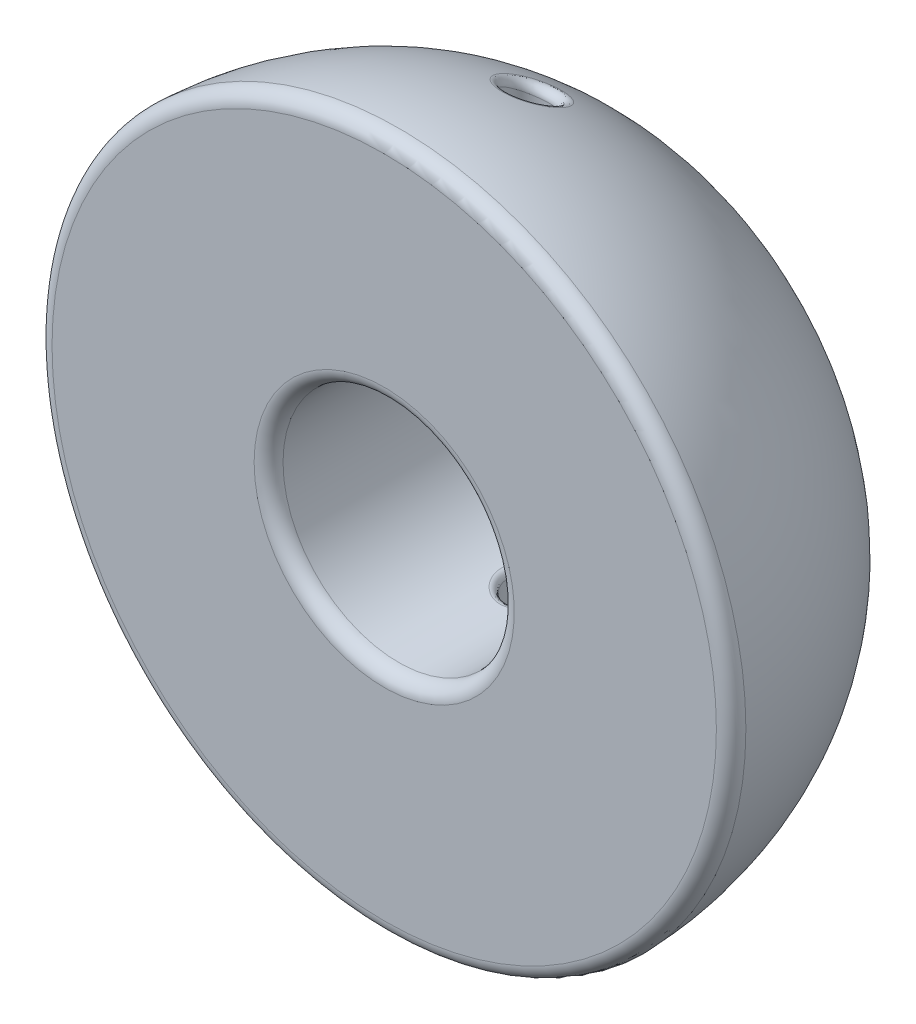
from build123d import *

# Parameters (mm, degrees)
FILLET_1_R          = 0.5
SKETCH_2_R          = 0.75
CUT_EXTRUDE_1_DEPTH = 15
FILLET_2_R          = 0.25


with BuildPart() as part:
    # Sketch 1 → Revolve 1 (revolve)
    with BuildSketch(Plane(origin=(0, 0, 0), x_dir=(0, 0, -1), z_dir=(1, 0, 0)), mode=Mode.PRIVATE) as revolve_1_sk:
        with BuildLine():
            Line((-5, 12), (-5, 4))
            Line((-5, 4), (5, 4))
            add(Edge.make_bspline(
                [(5, 4), (5, 12), (-5, 12)],
                knots=[0, 0, 0, 1.570796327, 1.570796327, 1.570796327], degree=2, weights=[1, 0.707106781, 1]))
        make_face()
    revolve(revolve_1_sk.sketch.rotate(Axis((0, 0, 5), (0, 0, -1)), 90), axis=Axis((0, 0, 5), (0, 0, -1)))

    # Fillet 1
    fillet_1_edges = [part.edges().sort_by_distance(p)[0] for p in [
        (-4, 0, -5),
        (-4, 0, 5),
        (-12, 0, 5),
    ]]
    fillet(fillet_1_edges, radius=FILLET_1_R)

    # Sketch 2 → Cut-Extrude 1 (cut, symmetric)
    with BuildSketch(Plane(origin=(0, 0, 0), x_dir=(1, 0, 0), z_dir=(0, 1, 0))):
        with Locations(Location((0, 0, 0), (0, 0, 270))):
            Circle(SKETCH_2_R)
    extrude(amount=CUT_EXTRUDE_1_DEPTH, both=True, mode=Mode.SUBTRACT)

    # Fillet 2
    fillet_2_edges = [part.edges().sort_by_distance(p)[0] for p in [
        (0, 4.000000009, -0.74999999),
        (0, 10.54522727, -0.750000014),
        (0, -4.000000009, -0.74999999),
        (0, -10.54522727, -0.750000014),
    ]]
    fillet(fillet_2_edges, radius=FILLET_2_R)


solid = part.part
